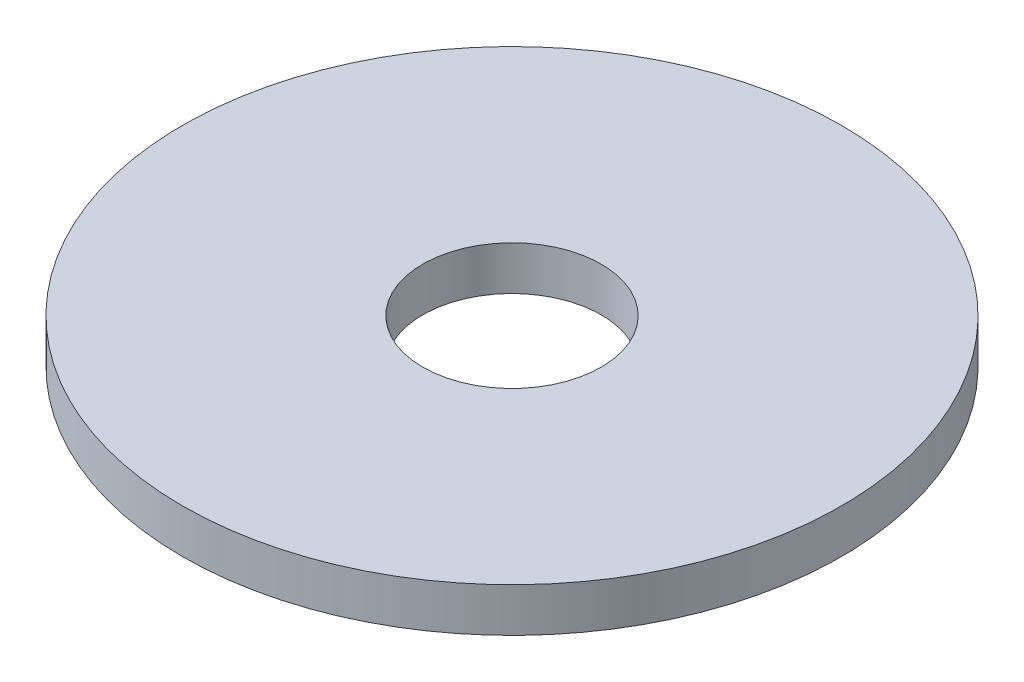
ISO-10303-21;
HEADER;
FILE_DESCRIPTION(('STEP AP214'),'2;1');
FILE_NAME('part.step','',(''),(''),'','','');
FILE_SCHEMA(('AUTOMOTIVE_DESIGN { 1 0 10303 214 1 1 1 1 }'));
ENDSEC;
DATA;
#1=APPLICATION_CONTEXT('core data for automotive mechanical design processes');
#2=APPLICATION_PROTOCOL_DEFINITION('international standard','automotive_design',2000,#1);
#3=PRODUCT_CONTEXT('',#1,'mechanical');
#4=PRODUCT('Part','Part','',(#3));
#5=PRODUCT_RELATED_PRODUCT_CATEGORY('part','',(#4));
#6=PRODUCT_DEFINITION_FORMATION('','',#4);
#7=PRODUCT_DEFINITION_CONTEXT('part definition',#1,'design');
#8=PRODUCT_DEFINITION('design','',#6,#7);
#9=PRODUCT_DEFINITION_SHAPE('','',#8);
#10=(LENGTH_UNIT() NAMED_UNIT(*) SI_UNIT(.MILLI.,.METRE.));
#11=(NAMED_UNIT(*) PLANE_ANGLE_UNIT() SI_UNIT($,.RADIAN.));
#12=(NAMED_UNIT(*) SI_UNIT($,.STERADIAN.) SOLID_ANGLE_UNIT());
#13=UNCERTAINTY_MEASURE_WITH_UNIT(LENGTH_MEASURE(1.E-05),#10,'distance_accuracy_value','');
#14=(GEOMETRIC_REPRESENTATION_CONTEXT(3) GLOBAL_UNCERTAINTY_ASSIGNED_CONTEXT((#13)) GLOBAL_UNIT_ASSIGNED_CONTEXT((#10,
#11,#12)) REPRESENTATION_CONTEXT('',''));
#15=CARTESIAN_POINT('',(0.,0.,0.));
#16=DIRECTION('',(0.,0.,1.));
#17=DIRECTION('',(1.,0.,0.));
#18=AXIS2_PLACEMENT_3D('',#15,#16,#17);
#19=CARTESIAN_POINT('',(0.,-0.8,0.));
#20=DIRECTION('',(0.,1.,0.));
#21=DIRECTION('',(0.,0.,1.));
#22=AXIS2_PLACEMENT_3D('',#19,#20,#21);
#23=CYLINDRICAL_SURFACE('',#22,6.);
#24=CARTESIAN_POINT('',(0.,-0.8,0.));
#25=DIRECTION('',(0.,1.,0.));
#26=DIRECTION('',(0.,0.,1.));
#27=AXIS2_PLACEMENT_3D('',#24,#25,#26);
#28=CIRCLE('',#27,6.);
#29=CARTESIAN_POINT('',(0.,-0.8,6.));
#30=VERTEX_POINT('',#29);
#31=EDGE_CURVE('E18',#30,#30,#28,.T.);
#32=ORIENTED_EDGE('',*,*,#31,.T.);
#33=EDGE_LOOP('',(#32));
#34=FACE_BOUND('',#33,.T.);
#35=CARTESIAN_POINT('',(0.,0.,0.));
#36=DIRECTION('',(0.,1.,0.));
#37=DIRECTION('',(0.,0.,1.));
#38=AXIS2_PLACEMENT_3D('',#35,#36,#37);
#39=CIRCLE('',#38,6.);
#40=CARTESIAN_POINT('',(0.,0.,6.));
#41=VERTEX_POINT('',#40);
#42=EDGE_CURVE('E27',#41,#41,#39,.T.);
#43=ORIENTED_EDGE('',*,*,#42,.F.);
#44=EDGE_LOOP('',(#43));
#45=FACE_BOUND('',#44,.T.);
#46=ADVANCED_FACE('F14',(#34,#45),#23,.T.);
#47=CARTESIAN_POINT('',(-6.072,-0.8,-6.072));
#48=DIRECTION('',(0.,1.,0.));
#49=DIRECTION('',(0.,0.,1.));
#50=AXIS2_PLACEMENT_3D('',#47,#48,#49);
#51=PLANE('',#50);
#52=CARTESIAN_POINT('',(0.,-0.8,0.));
#53=DIRECTION('',(0.,1.,0.));
#54=DIRECTION('',(0.,0.,1.));
#55=AXIS2_PLACEMENT_3D('',#52,#53,#54);
#56=CIRCLE('',#55,1.625);
#57=CARTESIAN_POINT('',(0.,-0.8,1.625));
#58=VERTEX_POINT('',#57);
#59=EDGE_CURVE('E22',#58,#58,#56,.F.);
#60=ORIENTED_EDGE('',*,*,#59,.F.);
#61=EDGE_LOOP('',(#60));
#62=FACE_BOUND('',#61,.T.);
#63=ORIENTED_EDGE('',*,*,#31,.F.);
#64=EDGE_LOOP('',(#63));
#65=FACE_BOUND('',#64,.T.);
#66=ADVANCED_FACE('F37',(#62,#65),#51,.F.);
#67=CARTESIAN_POINT('',(-6.072,0.,-6.072));
#68=DIRECTION('',(0.,1.,0.));
#69=DIRECTION('',(0.,0.,1.));
#70=AXIS2_PLACEMENT_3D('',#67,#68,#69);
#71=PLANE('',#70);
#72=CARTESIAN_POINT('',(0.,0.,0.));
#73=DIRECTION('',(0.,1.,0.));
#74=DIRECTION('',(0.,0.,1.));
#75=AXIS2_PLACEMENT_3D('',#72,#73,#74);
#76=CIRCLE('',#75,1.625);
#77=CARTESIAN_POINT('',(0.,0.,1.625));
#78=VERTEX_POINT('',#77);
#79=EDGE_CURVE('E9',#78,#78,#76,.T.);
#80=ORIENTED_EDGE('',*,*,#79,.F.);
#81=EDGE_LOOP('',(#80));
#82=FACE_BOUND('',#81,.T.);
#83=ORIENTED_EDGE('',*,*,#42,.T.);
#84=EDGE_LOOP('',(#83));
#85=FACE_BOUND('',#84,.T.);
#86=ADVANCED_FACE('F16',(#82,#85),#71,.T.);
#87=CARTESIAN_POINT('',(0.,-0.8,0.));
#88=DIRECTION('',(0.,1.,0.));
#89=DIRECTION('',(0.,0.,1.));
#90=AXIS2_PLACEMENT_3D('',#87,#88,#89);
#91=CYLINDRICAL_SURFACE('',#90,1.625);
#92=ORIENTED_EDGE('',*,*,#59,.T.);
#93=EDGE_LOOP('',(#92));
#94=FACE_BOUND('',#93,.T.);
#95=ORIENTED_EDGE('',*,*,#79,.T.);
#96=EDGE_LOOP('',(#95));
#97=FACE_BOUND('',#96,.T.);
#98=ADVANCED_FACE('F45',(#94,#97),#91,.F.);
#99=CLOSED_SHELL('',(#46,#66,#86,#98));
#100=MANIFOLD_SOLID_BREP('B1',#99);
#101=ADVANCED_BREP_SHAPE_REPRESENTATION('',(#18,#100),#14);
#102=SHAPE_DEFINITION_REPRESENTATION(#9,#101);
ENDSEC;
END-ISO-10303-21;
